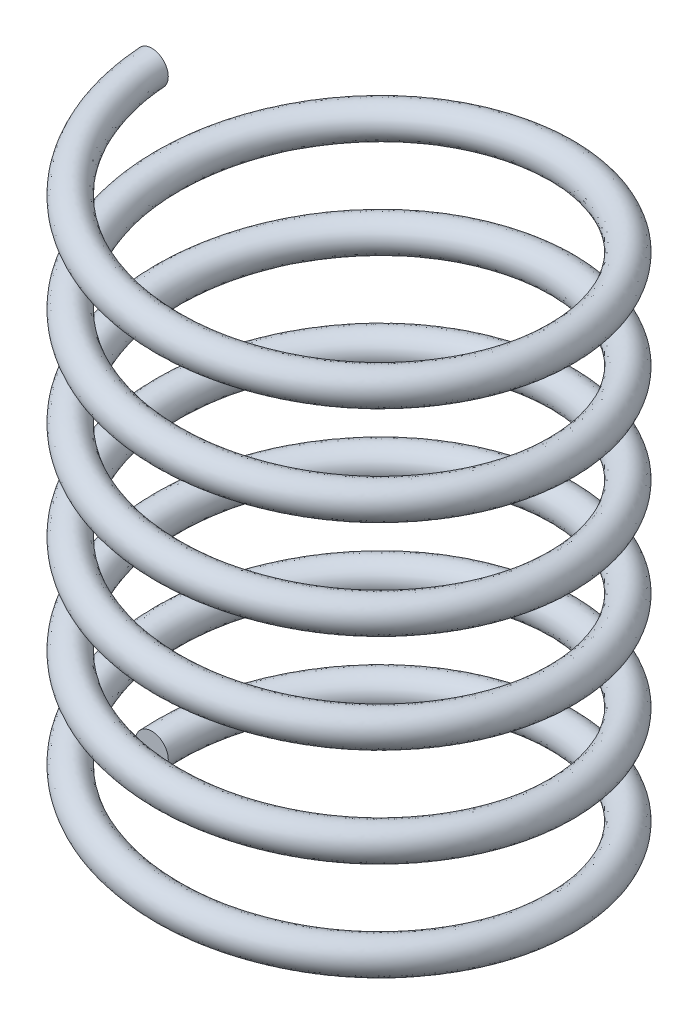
from build123d import *

# Parameters (mm, degrees)
SWEEP1_PITCH       = 2.38125
SWEEP1_HEIGHT      = 14.2875
SWEEP1_RADIUS      = 4.7625
SWEEP1_START_ANGLE = -90
SKETCH3_R          = 0.396875


with BuildPart() as part:
    # Sweep1: sweep along a helix
    with BuildLine() as sweep1_path:
        add(Helix(SWEEP1_PITCH, SWEEP1_HEIGHT, SWEEP1_RADIUS, center=(0, 0, 0), direction=(0, 1, 0), lefthand=True, mode=Mode.PRIVATE).rotate(Axis((0, 0, 0), (0, 1, 0)), SWEEP1_START_ANGLE))
    # Sketch3 → Sweep1 (sweep)
    with BuildSketch(Plane.XY):
        with Locations((-4.7625, 0)):
            Circle(SKETCH3_R)
    sweep(path=sweep1_path.line, is_frenet=True)


solid = part.part
